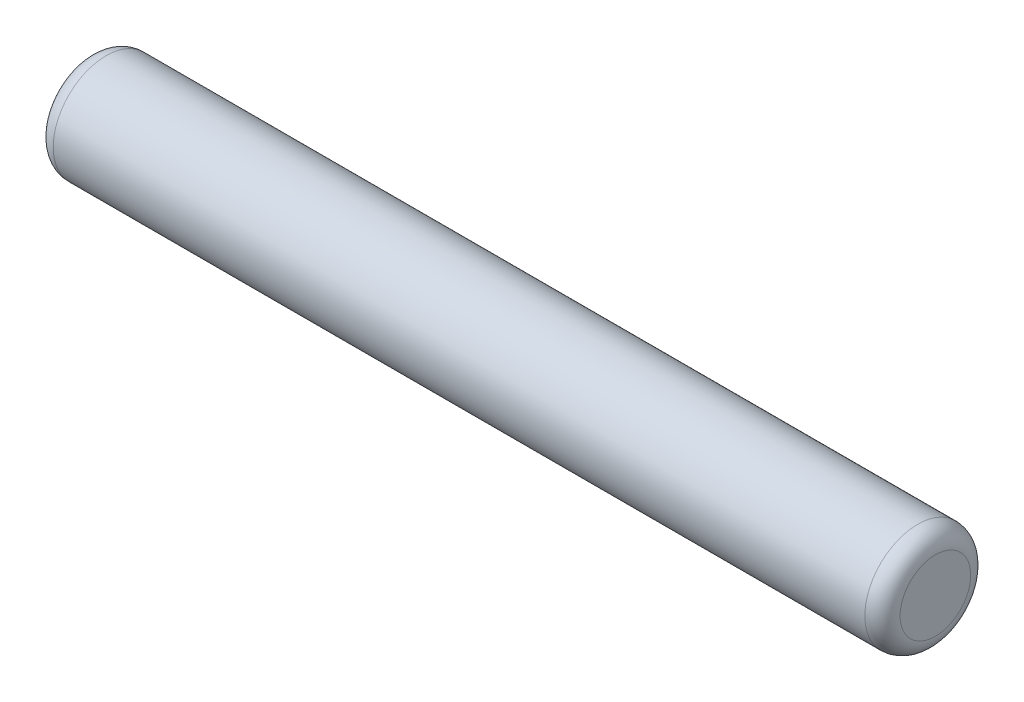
from build123d import *

# Parameters (mm, degrees)
SKETCH_1_R      = 1.5
EXTRUDE_1_DEPTH = 12
FILLET_1_R      = 0.5


with BuildPart() as part:
    # Sketch 1 → Extrude 1 (new, symmetric)
    with BuildSketch(Plane(origin=(0, 0, 0), x_dir=(0, 0, -1), z_dir=(1, 0, 0))):
        Circle(SKETCH_1_R)
    extrude(amount=EXTRUDE_1_DEPTH, both=True)

    # Fillet 1
    fillet_1_edges = [part.edges().sort_by_distance(p)[0] for p in [
        (-12, 0, 1.5),
        (12, 0, 1.5),
    ]]
    fillet(fillet_1_edges, radius=FILLET_1_R)


solid = part.part
